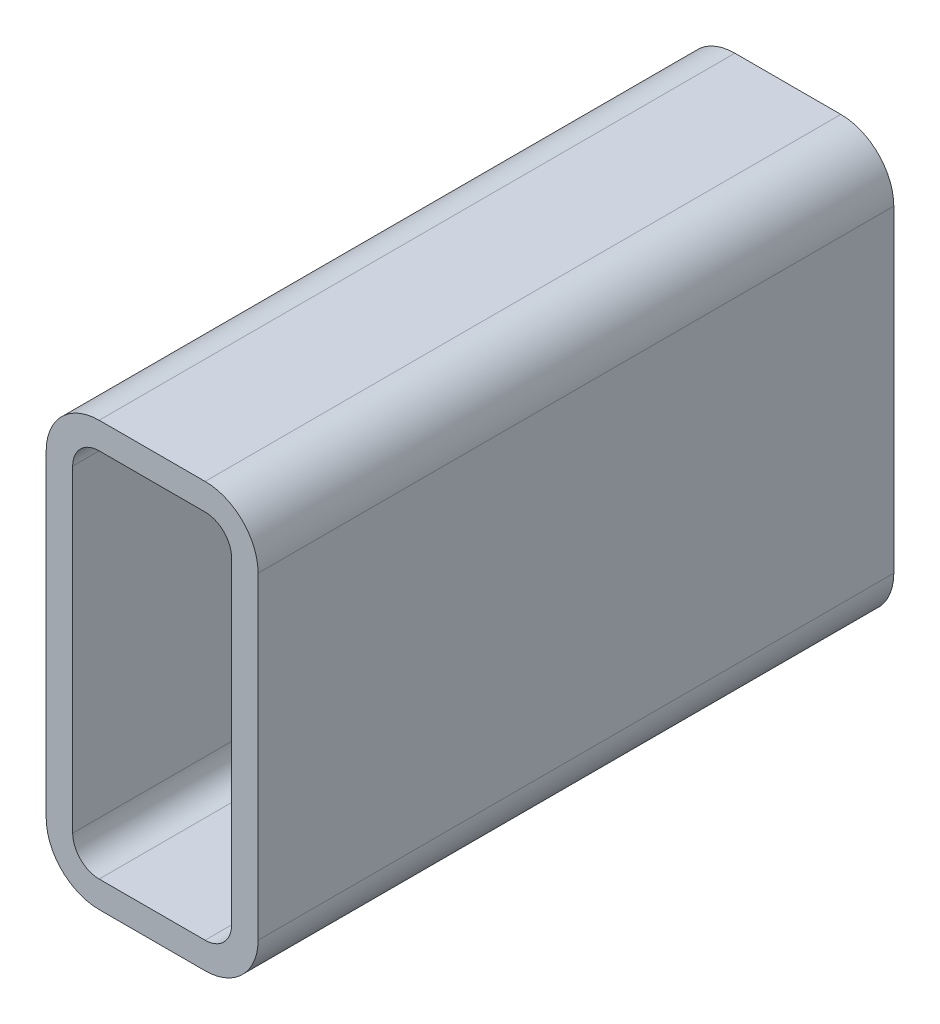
ISO-10303-21;
HEADER;
FILE_DESCRIPTION(('STEP AP214'),'2;1');
FILE_NAME('part.step','',(''),(''),'','','');
FILE_SCHEMA(('AUTOMOTIVE_DESIGN { 1 0 10303 214 1 1 1 1 }'));
ENDSEC;
DATA;
#1=APPLICATION_CONTEXT('core data for automotive mechanical design processes');
#2=APPLICATION_PROTOCOL_DEFINITION('international standard','automotive_design',2000,#1);
#3=PRODUCT_CONTEXT('',#1,'mechanical');
#4=PRODUCT('Part','Part','',(#3));
#5=PRODUCT_RELATED_PRODUCT_CATEGORY('part','',(#4));
#6=PRODUCT_DEFINITION_FORMATION('','',#4);
#7=PRODUCT_DEFINITION_CONTEXT('part definition',#1,'design');
#8=PRODUCT_DEFINITION('design','',#6,#7);
#9=PRODUCT_DEFINITION_SHAPE('','',#8);
#10=(LENGTH_UNIT() NAMED_UNIT(*) SI_UNIT(.MILLI.,.METRE.));
#11=(NAMED_UNIT(*) PLANE_ANGLE_UNIT() SI_UNIT($,.RADIAN.));
#12=(NAMED_UNIT(*) SI_UNIT($,.STERADIAN.) SOLID_ANGLE_UNIT());
#13=UNCERTAINTY_MEASURE_WITH_UNIT(LENGTH_MEASURE(1.E-05),#10,'distance_accuracy_value','');
#14=(GEOMETRIC_REPRESENTATION_CONTEXT(3) GLOBAL_UNCERTAINTY_ASSIGNED_CONTEXT((#13)) GLOBAL_UNIT_ASSIGNED_CONTEXT((#10,
#11,#12)) REPRESENTATION_CONTEXT('',''));
#15=CARTESIAN_POINT('',(0.,0.,0.));
#16=DIRECTION('',(0.,0.,1.));
#17=DIRECTION('',(1.,0.,0.));
#18=AXIS2_PLACEMENT_3D('',#15,#16,#17);
#19=CARTESIAN_POINT('',(27.0751778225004,179.766130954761,304.8));
#20=DIRECTION('',(0.,0.,1.));
#21=DIRECTION('',(1.,0.,0.));
#22=AXIS2_PLACEMENT_3D('',#19,#20,#21);
#23=PLANE('',#22);
#24=CARTESIAN_POINT('',(27.0751778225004,179.766130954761,304.8));
#25=DIRECTION('',(0.,0.,1.));
#26=DIRECTION('',(1.,0.,0.));
#27=AXIS2_PLACEMENT_3D('',#24,#25,#26);
#28=CIRCLE('',#27,25.4);
#29=CARTESIAN_POINT('',(27.0751778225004,205.166130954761,304.8));
#30=VERTEX_POINT('',#29);
#31=CARTESIAN_POINT('',(1.67517782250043,179.766130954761,304.8));
#32=VERTEX_POINT('',#31);
#33=EDGE_CURVE('E211',#30,#32,#28,.T.);
#34=ORIENTED_EDGE('',*,*,#33,.T.);
#35=DIRECTION('',(0.,-1.,0.));
#36=VECTOR('',#35,1.);
#37=CARTESIAN_POINT('',(1.67517782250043,27.3661309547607,304.8));
#38=LINE('',#37,#36);
#39=CARTESIAN_POINT('',(1.67517782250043,27.3661309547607,304.8));
#40=VERTEX_POINT('',#39);
#41=EDGE_CURVE('E214',#32,#40,#38,.T.);
#42=ORIENTED_EDGE('',*,*,#41,.T.);
#43=CARTESIAN_POINT('',(27.0751778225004,27.3661309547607,304.8));
#44=DIRECTION('',(0.,0.,1.));
#45=DIRECTION('',(1.,0.,0.));
#46=AXIS2_PLACEMENT_3D('',#43,#44,#45);
#47=CIRCLE('',#46,25.4);
#48=CARTESIAN_POINT('',(27.0751778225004,1.96613095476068,304.8));
#49=VERTEX_POINT('',#48);
#50=EDGE_CURVE('E217',#40,#49,#47,.T.);
#51=ORIENTED_EDGE('',*,*,#50,.T.);
#52=DIRECTION('',(1.,0.,0.));
#53=VECTOR('',#52,1.);
#54=CARTESIAN_POINT('',(77.8751778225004,1.96613095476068,304.8));
#55=LINE('',#54,#53);
#56=CARTESIAN_POINT('',(77.8751778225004,1.96613095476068,304.8));
#57=VERTEX_POINT('',#56);
#58=EDGE_CURVE('E219',#49,#57,#55,.T.);
#59=ORIENTED_EDGE('',*,*,#58,.T.);
#60=CARTESIAN_POINT('',(77.8751778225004,27.3661309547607,304.8));
#61=DIRECTION('',(0.,0.,1.));
#62=DIRECTION('',(1.,0.,0.));
#63=AXIS2_PLACEMENT_3D('',#60,#61,#62);
#64=CIRCLE('',#63,25.4);
#65=CARTESIAN_POINT('',(103.2751778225,27.3661309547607,304.8));
#66=VERTEX_POINT('',#65);
#67=EDGE_CURVE('E221',#57,#66,#64,.T.);
#68=ORIENTED_EDGE('',*,*,#67,.T.);
#69=DIRECTION('',(0.,1.,0.));
#70=VECTOR('',#69,1.);
#71=CARTESIAN_POINT('',(103.2751778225,179.766130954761,304.8));
#72=LINE('',#71,#70);
#73=CARTESIAN_POINT('',(103.2751778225,179.766130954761,304.8));
#74=VERTEX_POINT('',#73);
#75=EDGE_CURVE('E223',#66,#74,#72,.T.);
#76=ORIENTED_EDGE('',*,*,#75,.T.);
#77=CARTESIAN_POINT('',(77.8751778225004,179.766130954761,304.8));
#78=DIRECTION('',(0.,0.,1.));
#79=DIRECTION('',(1.,0.,0.));
#80=AXIS2_PLACEMENT_3D('',#77,#78,#79);
#81=CIRCLE('',#80,25.4);
#82=CARTESIAN_POINT('',(77.8751778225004,205.166130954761,304.8));
#83=VERTEX_POINT('',#82);
#84=EDGE_CURVE('E225',#74,#83,#81,.T.);
#85=ORIENTED_EDGE('',*,*,#84,.T.);
#86=DIRECTION('',(-1.,0.,0.));
#87=VECTOR('',#86,1.);
#88=CARTESIAN_POINT('',(27.0751778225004,205.166130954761,304.8));
#89=LINE('',#88,#87);
#90=EDGE_CURVE('E227',#83,#30,#89,.T.);
#91=ORIENTED_EDGE('',*,*,#90,.T.);
#92=EDGE_LOOP('',(#34,#42,#51,#59,#68,#76,#85,#91));
#93=FACE_BOUND('',#92,.T.);
#94=DIRECTION('',(0.,-1.,0.));
#95=VECTOR('',#94,1.);
#96=CARTESIAN_POINT('',(14.3751778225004,27.3661309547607,304.8));
#97=LINE('',#96,#95);
#98=CARTESIAN_POINT('',(14.3751778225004,179.766130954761,304.8));
#99=VERTEX_POINT('',#98);
#100=CARTESIAN_POINT('',(14.3751778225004,27.3661309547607,304.8));
#101=VERTEX_POINT('',#100);
#102=EDGE_CURVE('E154',#99,#101,#97,.T.);
#103=ORIENTED_EDGE('',*,*,#102,.F.);
#104=CARTESIAN_POINT('',(27.0751778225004,179.766130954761,304.8));
#105=DIRECTION('',(0.,0.,1.));
#106=DIRECTION('',(1.,0.,0.));
#107=AXIS2_PLACEMENT_3D('',#104,#105,#106);
#108=CIRCLE('',#107,12.7);
#109=CARTESIAN_POINT('',(27.0751778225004,192.466130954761,304.8));
#110=VERTEX_POINT('',#109);
#111=EDGE_CURVE('E146',#110,#99,#108,.T.);
#112=ORIENTED_EDGE('',*,*,#111,.F.);
#113=DIRECTION('',(-1.,0.,0.));
#114=VECTOR('',#113,1.);
#115=CARTESIAN_POINT('',(27.0751778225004,192.466130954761,304.8));
#116=LINE('',#115,#114);
#117=CARTESIAN_POINT('',(77.8751778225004,192.466130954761,304.8));
#118=VERTEX_POINT('',#117);
#119=EDGE_CURVE('E179',#118,#110,#116,.T.);
#120=ORIENTED_EDGE('',*,*,#119,.F.);
#121=CARTESIAN_POINT('',(77.8751778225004,179.766130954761,304.8));
#122=DIRECTION('',(0.,0.,1.));
#123=DIRECTION('',(1.,0.,0.));
#124=AXIS2_PLACEMENT_3D('',#121,#122,#123);
#125=CIRCLE('',#124,12.7);
#126=CARTESIAN_POINT('',(90.5751778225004,179.766130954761,304.8));
#127=VERTEX_POINT('',#126);
#128=EDGE_CURVE('E177',#127,#118,#125,.T.);
#129=ORIENTED_EDGE('',*,*,#128,.F.);
#130=DIRECTION('',(0.,1.,0.));
#131=VECTOR('',#130,1.);
#132=CARTESIAN_POINT('',(90.5751778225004,179.766130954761,304.8));
#133=LINE('',#132,#131);
#134=CARTESIAN_POINT('',(90.5751778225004,27.3661309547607,304.8));
#135=VERTEX_POINT('',#134);
#136=EDGE_CURVE('E175',#135,#127,#133,.T.);
#137=ORIENTED_EDGE('',*,*,#136,.F.);
#138=CARTESIAN_POINT('',(77.8751778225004,27.3661309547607,304.8));
#139=DIRECTION('',(0.,0.,1.));
#140=DIRECTION('',(1.,0.,0.));
#141=AXIS2_PLACEMENT_3D('',#138,#139,#140);
#142=CIRCLE('',#141,12.7);
#143=CARTESIAN_POINT('',(77.8751778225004,14.6661309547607,304.8));
#144=VERTEX_POINT('',#143);
#145=EDGE_CURVE('E173',#144,#135,#142,.T.);
#146=ORIENTED_EDGE('',*,*,#145,.F.);
#147=DIRECTION('',(1.,0.,0.));
#148=VECTOR('',#147,1.);
#149=CARTESIAN_POINT('',(77.8751778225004,14.6661309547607,304.8));
#150=LINE('',#149,#148);
#151=CARTESIAN_POINT('',(27.0751778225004,14.6661309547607,304.8));
#152=VERTEX_POINT('',#151);
#153=EDGE_CURVE('E169',#152,#144,#150,.T.);
#154=ORIENTED_EDGE('',*,*,#153,.F.);
#155=CARTESIAN_POINT('',(27.0751778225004,27.3661309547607,304.8));
#156=DIRECTION('',(0.,0.,1.));
#157=DIRECTION('',(1.,0.,0.));
#158=AXIS2_PLACEMENT_3D('',#155,#156,#157);
#159=CIRCLE('',#158,12.7);
#160=EDGE_CURVE('E167',#101,#152,#159,.T.);
#161=ORIENTED_EDGE('',*,*,#160,.F.);
#162=EDGE_LOOP('',(#103,#112,#120,#129,#137,#146,#154,#161));
#163=FACE_BOUND('',#162,.T.);
#164=ADVANCED_FACE('F33',(#93,#163),#23,.T.);
#165=CARTESIAN_POINT('',(27.0751778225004,179.766130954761,0.));
#166=DIRECTION('',(0.,0.,1.));
#167=DIRECTION('',(1.,0.,0.));
#168=AXIS2_PLACEMENT_3D('',#165,#166,#167);
#169=PLANE('',#168);
#170=CARTESIAN_POINT('',(27.0751778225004,179.766130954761,0.));
#171=DIRECTION('',(0.,0.,1.));
#172=DIRECTION('',(1.,0.,0.));
#173=AXIS2_PLACEMENT_3D('',#170,#171,#172);
#174=CIRCLE('',#173,25.4);
#175=CARTESIAN_POINT('',(27.0751778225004,205.166130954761,0.));
#176=VERTEX_POINT('',#175);
#177=CARTESIAN_POINT('',(1.67517782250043,179.766130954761,0.));
#178=VERTEX_POINT('',#177);
#179=EDGE_CURVE('E162',#176,#178,#174,.T.);
#180=ORIENTED_EDGE('',*,*,#179,.F.);
#181=DIRECTION('',(-1.,0.,0.));
#182=VECTOR('',#181,1.);
#183=CARTESIAN_POINT('',(27.0751778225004,205.166130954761,0.));
#184=LINE('',#183,#182);
#185=CARTESIAN_POINT('',(77.8751778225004,205.166130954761,0.));
#186=VERTEX_POINT('',#185);
#187=EDGE_CURVE('E215',#186,#176,#184,.T.);
#188=ORIENTED_EDGE('',*,*,#187,.F.);
#189=CARTESIAN_POINT('',(77.8751778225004,179.766130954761,0.));
#190=DIRECTION('',(0.,0.,1.));
#191=DIRECTION('',(1.,0.,0.));
#192=AXIS2_PLACEMENT_3D('',#189,#190,#191);
#193=CIRCLE('',#192,25.4);
#194=CARTESIAN_POINT('',(103.2751778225,179.766130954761,0.));
#195=VERTEX_POINT('',#194);
#196=EDGE_CURVE('E242',#195,#186,#193,.T.);
#197=ORIENTED_EDGE('',*,*,#196,.F.);
#198=DIRECTION('',(0.,1.,0.));
#199=VECTOR('',#198,1.);
#200=CARTESIAN_POINT('',(103.2751778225,179.766130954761,0.));
#201=LINE('',#200,#199);
#202=CARTESIAN_POINT('',(103.2751778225,27.3661309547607,0.));
#203=VERTEX_POINT('',#202);
#204=EDGE_CURVE('E240',#203,#195,#201,.T.);
#205=ORIENTED_EDGE('',*,*,#204,.F.);
#206=CARTESIAN_POINT('',(77.8751778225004,27.3661309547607,0.));
#207=DIRECTION('',(0.,0.,1.));
#208=DIRECTION('',(1.,0.,0.));
#209=AXIS2_PLACEMENT_3D('',#206,#207,#208);
#210=CIRCLE('',#209,25.4);
#211=CARTESIAN_POINT('',(77.8751778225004,1.96613095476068,0.));
#212=VERTEX_POINT('',#211);
#213=EDGE_CURVE('E238',#212,#203,#210,.T.);
#214=ORIENTED_EDGE('',*,*,#213,.F.);
#215=DIRECTION('',(1.,0.,0.));
#216=VECTOR('',#215,1.);
#217=CARTESIAN_POINT('',(77.8751778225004,1.96613095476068,0.));
#218=LINE('',#217,#216);
#219=CARTESIAN_POINT('',(27.0751778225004,1.96613095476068,0.));
#220=VERTEX_POINT('',#219);
#221=EDGE_CURVE('E236',#220,#212,#218,.T.);
#222=ORIENTED_EDGE('',*,*,#221,.F.);
#223=CARTESIAN_POINT('',(27.0751778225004,27.3661309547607,0.));
#224=DIRECTION('',(0.,0.,1.));
#225=DIRECTION('',(1.,0.,0.));
#226=AXIS2_PLACEMENT_3D('',#223,#224,#225);
#227=CIRCLE('',#226,25.4);
#228=CARTESIAN_POINT('',(1.67517782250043,27.3661309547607,0.));
#229=VERTEX_POINT('',#228);
#230=EDGE_CURVE('E234',#229,#220,#227,.T.);
#231=ORIENTED_EDGE('',*,*,#230,.F.);
#232=DIRECTION('',(0.,-1.,0.));
#233=VECTOR('',#232,1.);
#234=CARTESIAN_POINT('',(1.67517782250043,27.3661309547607,0.));
#235=LINE('',#234,#233);
#236=EDGE_CURVE('E232',#178,#229,#235,.T.);
#237=ORIENTED_EDGE('',*,*,#236,.F.);
#238=EDGE_LOOP('',(#180,#188,#197,#205,#214,#222,#231,#237));
#239=FACE_BOUND('',#238,.T.);
#240=CARTESIAN_POINT('',(27.0751778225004,179.766130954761,0.));
#241=DIRECTION('',(0.,0.,1.));
#242=DIRECTION('',(1.,0.,0.));
#243=AXIS2_PLACEMENT_3D('',#240,#241,#242);
#244=CIRCLE('',#243,12.7);
#245=CARTESIAN_POINT('',(27.0751778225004,192.466130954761,0.));
#246=VERTEX_POINT('',#245);
#247=CARTESIAN_POINT('',(14.3751778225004,179.766130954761,0.));
#248=VERTEX_POINT('',#247);
#249=EDGE_CURVE('E56',#246,#248,#244,.T.);
#250=ORIENTED_EDGE('',*,*,#249,.T.);
#251=DIRECTION('',(0.,-1.,0.));
#252=VECTOR('',#251,1.);
#253=CARTESIAN_POINT('',(14.3751778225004,27.3661309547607,0.));
#254=LINE('',#253,#252);
#255=CARTESIAN_POINT('',(14.3751778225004,27.3661309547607,0.));
#256=VERTEX_POINT('',#255);
#257=EDGE_CURVE('E161',#248,#256,#254,.T.);
#258=ORIENTED_EDGE('',*,*,#257,.T.);
#259=CARTESIAN_POINT('',(27.0751778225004,27.3661309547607,0.));
#260=DIRECTION('',(0.,0.,1.));
#261=DIRECTION('',(1.,0.,0.));
#262=AXIS2_PLACEMENT_3D('',#259,#260,#261);
#263=CIRCLE('',#262,12.7);
#264=CARTESIAN_POINT('',(27.0751778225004,14.6661309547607,0.));
#265=VERTEX_POINT('',#264);
#266=EDGE_CURVE('E183',#256,#265,#263,.T.);
#267=ORIENTED_EDGE('',*,*,#266,.T.);
#268=DIRECTION('',(1.,0.,0.));
#269=VECTOR('',#268,1.);
#270=CARTESIAN_POINT('',(77.8751778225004,14.6661309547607,0.));
#271=LINE('',#270,#269);
#272=CARTESIAN_POINT('',(77.8751778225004,14.6661309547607,0.));
#273=VERTEX_POINT('',#272);
#274=EDGE_CURVE('E186',#265,#273,#271,.T.);
#275=ORIENTED_EDGE('',*,*,#274,.T.);
#276=CARTESIAN_POINT('',(77.8751778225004,27.3661309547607,0.));
#277=DIRECTION('',(0.,0.,1.));
#278=DIRECTION('',(1.,0.,0.));
#279=AXIS2_PLACEMENT_3D('',#276,#277,#278);
#280=CIRCLE('',#279,12.7);
#281=CARTESIAN_POINT('',(90.5751778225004,27.3661309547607,0.));
#282=VERTEX_POINT('',#281);
#283=EDGE_CURVE('E189',#273,#282,#280,.T.);
#284=ORIENTED_EDGE('',*,*,#283,.T.);
#285=DIRECTION('',(0.,1.,0.));
#286=VECTOR('',#285,1.);
#287=CARTESIAN_POINT('',(90.5751778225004,179.766130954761,0.));
#288=LINE('',#287,#286);
#289=CARTESIAN_POINT('',(90.5751778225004,179.766130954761,0.));
#290=VERTEX_POINT('',#289);
#291=EDGE_CURVE('E192',#282,#290,#288,.T.);
#292=ORIENTED_EDGE('',*,*,#291,.T.);
#293=CARTESIAN_POINT('',(77.8751778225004,179.766130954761,0.));
#294=DIRECTION('',(0.,0.,1.));
#295=DIRECTION('',(1.,0.,0.));
#296=AXIS2_PLACEMENT_3D('',#293,#294,#295);
#297=CIRCLE('',#296,12.7);
#298=CARTESIAN_POINT('',(77.8751778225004,192.466130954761,0.));
#299=VERTEX_POINT('',#298);
#300=EDGE_CURVE('E195',#290,#299,#297,.T.);
#301=ORIENTED_EDGE('',*,*,#300,.T.);
#302=DIRECTION('',(-1.,0.,0.));
#303=VECTOR('',#302,1.);
#304=CARTESIAN_POINT('',(27.0751778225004,192.466130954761,0.));
#305=LINE('',#304,#303);
#306=EDGE_CURVE('E155',#299,#246,#305,.T.);
#307=ORIENTED_EDGE('',*,*,#306,.T.);
#308=EDGE_LOOP('',(#250,#258,#267,#275,#284,#292,#301,#307));
#309=FACE_BOUND('',#308,.T.);
#310=ADVANCED_FACE('F272',(#239,#309),#169,.F.);
#311=CARTESIAN_POINT('',(27.0751778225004,179.766130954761,304.8));
#312=DIRECTION('',(0.,0.,-1.));
#313=DIRECTION('',(-1.,0.,0.));
#314=AXIS2_PLACEMENT_3D('',#311,#312,#313);
#315=CYLINDRICAL_SURFACE('',#314,25.4);
#316=ORIENTED_EDGE('',*,*,#179,.T.);
#317=DIRECTION('',(0.,0.,-1.));
#318=VECTOR('',#317,1.);
#319=CARTESIAN_POINT('',(1.67517782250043,179.766130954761,304.8));
#320=LINE('',#319,#318);
#321=EDGE_CURVE('E11',#32,#178,#320,.T.);
#322=ORIENTED_EDGE('',*,*,#321,.F.);
#323=ORIENTED_EDGE('',*,*,#33,.F.);
#324=DIRECTION('',(0.,0.,-1.));
#325=VECTOR('',#324,1.);
#326=CARTESIAN_POINT('',(27.0751778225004,205.166130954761,304.8));
#327=LINE('',#326,#325);
#328=EDGE_CURVE('E229',#30,#176,#327,.T.);
#329=ORIENTED_EDGE('',*,*,#328,.T.);
#330=EDGE_LOOP('',(#316,#322,#323,#329));
#331=FACE_BOUND('',#330,.T.);
#332=ADVANCED_FACE('F35',(#331),#315,.T.);
#333=CARTESIAN_POINT('',(1.67517782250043,27.3661309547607,304.8));
#334=DIRECTION('',(1.,0.,0.));
#335=DIRECTION('',(0.,0.,-1.));
#336=AXIS2_PLACEMENT_3D('',#333,#334,#335);
#337=PLANE('',#336);
#338=ORIENTED_EDGE('',*,*,#236,.T.);
#339=DIRECTION('',(0.,0.,-1.));
#340=VECTOR('',#339,1.);
#341=CARTESIAN_POINT('',(1.67517782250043,27.3661309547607,304.8));
#342=LINE('',#341,#340);
#343=EDGE_CURVE('E41',#40,#229,#342,.T.);
#344=ORIENTED_EDGE('',*,*,#343,.F.);
#345=ORIENTED_EDGE('',*,*,#41,.F.);
#346=ORIENTED_EDGE('',*,*,#321,.T.);
#347=EDGE_LOOP('',(#338,#344,#345,#346));
#348=FACE_BOUND('',#347,.T.);
#349=ADVANCED_FACE('F289',(#348),#337,.F.);
#350=CARTESIAN_POINT('',(27.0751778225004,27.3661309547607,304.8));
#351=DIRECTION('',(0.,0.,-1.));
#352=DIRECTION('',(-1.,0.,0.));
#353=AXIS2_PLACEMENT_3D('',#350,#351,#352);
#354=CYLINDRICAL_SURFACE('',#353,25.4);
#355=ORIENTED_EDGE('',*,*,#230,.T.);
#356=DIRECTION('',(0.,0.,-1.));
#357=VECTOR('',#356,1.);
#358=CARTESIAN_POINT('',(27.0751778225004,1.96613095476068,304.8));
#359=LINE('',#358,#357);
#360=EDGE_CURVE('E259',#49,#220,#359,.T.);
#361=ORIENTED_EDGE('',*,*,#360,.F.);
#362=ORIENTED_EDGE('',*,*,#50,.F.);
#363=ORIENTED_EDGE('',*,*,#343,.T.);
#364=EDGE_LOOP('',(#355,#361,#362,#363));
#365=FACE_BOUND('',#364,.T.);
#366=ADVANCED_FACE('F266',(#365),#354,.T.);
#367=CARTESIAN_POINT('',(77.8751778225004,1.96613095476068,304.8));
#368=DIRECTION('',(0.,1.,0.));
#369=DIRECTION('',(0.,0.,1.));
#370=AXIS2_PLACEMENT_3D('',#367,#368,#369);
#371=PLANE('',#370);
#372=ORIENTED_EDGE('',*,*,#221,.T.);
#373=DIRECTION('',(0.,0.,-1.));
#374=VECTOR('',#373,1.);
#375=CARTESIAN_POINT('',(77.8751778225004,1.96613095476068,304.8));
#376=LINE('',#375,#374);
#377=EDGE_CURVE('E256',#57,#212,#376,.T.);
#378=ORIENTED_EDGE('',*,*,#377,.F.);
#379=ORIENTED_EDGE('',*,*,#58,.F.);
#380=ORIENTED_EDGE('',*,*,#360,.T.);
#381=EDGE_LOOP('',(#372,#378,#379,#380));
#382=FACE_BOUND('',#381,.T.);
#383=ADVANCED_FACE('F278',(#382),#371,.F.);
#384=CARTESIAN_POINT('',(77.8751778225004,27.3661309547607,304.8));
#385=DIRECTION('',(0.,0.,-1.));
#386=DIRECTION('',(-1.,0.,0.));
#387=AXIS2_PLACEMENT_3D('',#384,#385,#386);
#388=CYLINDRICAL_SURFACE('',#387,25.4);
#389=ORIENTED_EDGE('',*,*,#213,.T.);
#390=DIRECTION('',(0.,0.,-1.));
#391=VECTOR('',#390,1.);
#392=CARTESIAN_POINT('',(103.2751778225,27.3661309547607,304.8));
#393=LINE('',#392,#391);
#394=EDGE_CURVE('E253',#66,#203,#393,.T.);
#395=ORIENTED_EDGE('',*,*,#394,.F.);
#396=ORIENTED_EDGE('',*,*,#67,.F.);
#397=ORIENTED_EDGE('',*,*,#377,.T.);
#398=EDGE_LOOP('',(#389,#395,#396,#397));
#399=FACE_BOUND('',#398,.T.);
#400=ADVANCED_FACE('F282',(#399),#388,.T.);
#401=CARTESIAN_POINT('',(103.2751778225,179.766130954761,304.8));
#402=DIRECTION('',(-1.,0.,0.));
#403=DIRECTION('',(0.,0.,1.));
#404=AXIS2_PLACEMENT_3D('',#401,#402,#403);
#405=PLANE('',#404);
#406=ORIENTED_EDGE('',*,*,#204,.T.);
#407=DIRECTION('',(0.,0.,-1.));
#408=VECTOR('',#407,1.);
#409=CARTESIAN_POINT('',(103.2751778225,179.766130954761,304.8));
#410=LINE('',#409,#408);
#411=EDGE_CURVE('E250',#74,#195,#410,.T.);
#412=ORIENTED_EDGE('',*,*,#411,.F.);
#413=ORIENTED_EDGE('',*,*,#75,.F.);
#414=ORIENTED_EDGE('',*,*,#394,.T.);
#415=EDGE_LOOP('',(#406,#412,#413,#414));
#416=FACE_BOUND('',#415,.T.);
#417=ADVANCED_FACE('F302',(#416),#405,.F.);
#418=CARTESIAN_POINT('',(77.8751778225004,179.766130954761,304.8));
#419=DIRECTION('',(0.,0.,-1.));
#420=DIRECTION('',(-1.,0.,0.));
#421=AXIS2_PLACEMENT_3D('',#418,#419,#420);
#422=CYLINDRICAL_SURFACE('',#421,25.4);
#423=ORIENTED_EDGE('',*,*,#196,.T.);
#424=DIRECTION('',(0.,0.,-1.));
#425=VECTOR('',#424,1.);
#426=CARTESIAN_POINT('',(77.8751778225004,205.166130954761,304.8));
#427=LINE('',#426,#425);
#428=EDGE_CURVE('E247',#83,#186,#427,.T.);
#429=ORIENTED_EDGE('',*,*,#428,.F.);
#430=ORIENTED_EDGE('',*,*,#84,.F.);
#431=ORIENTED_EDGE('',*,*,#411,.T.);
#432=EDGE_LOOP('',(#423,#429,#430,#431));
#433=FACE_BOUND('',#432,.T.);
#434=ADVANCED_FACE('F300',(#433),#422,.T.);
#435=CARTESIAN_POINT('',(27.0751778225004,205.166130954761,304.8));
#436=DIRECTION('',(0.,-1.,0.));
#437=DIRECTION('',(0.,0.,-1.));
#438=AXIS2_PLACEMENT_3D('',#435,#436,#437);
#439=PLANE('',#438);
#440=ORIENTED_EDGE('',*,*,#187,.T.);
#441=ORIENTED_EDGE('',*,*,#328,.F.);
#442=ORIENTED_EDGE('',*,*,#90,.F.);
#443=ORIENTED_EDGE('',*,*,#428,.T.);
#444=EDGE_LOOP('',(#440,#441,#442,#443));
#445=FACE_BOUND('',#444,.T.);
#446=ADVANCED_FACE('F295',(#445),#439,.F.);
#447=CARTESIAN_POINT('',(27.0751778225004,179.766130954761,304.8));
#448=DIRECTION('',(0.,0.,-1.));
#449=DIRECTION('',(-1.,0.,0.));
#450=AXIS2_PLACEMENT_3D('',#447,#448,#449);
#451=CYLINDRICAL_SURFACE('',#450,12.7);
#452=ORIENTED_EDGE('',*,*,#249,.F.);
#453=DIRECTION('',(0.,0.,-1.));
#454=VECTOR('',#453,1.);
#455=CARTESIAN_POINT('',(27.0751778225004,192.466130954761,304.8));
#456=LINE('',#455,#454);
#457=EDGE_CURVE('E150',#110,#246,#456,.T.);
#458=ORIENTED_EDGE('',*,*,#457,.F.);
#459=ORIENTED_EDGE('',*,*,#111,.T.);
#460=DIRECTION('',(0.,0.,-1.));
#461=VECTOR('',#460,1.);
#462=CARTESIAN_POINT('',(14.3751778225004,179.766130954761,304.8));
#463=LINE('',#462,#461);
#464=EDGE_CURVE('E149',#99,#248,#463,.T.);
#465=ORIENTED_EDGE('',*,*,#464,.T.);
#466=EDGE_LOOP('',(#452,#458,#459,#465));
#467=FACE_BOUND('',#466,.T.);
#468=ADVANCED_FACE('F148',(#467),#451,.F.);
#469=CARTESIAN_POINT('',(14.3751778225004,27.3661309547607,304.8));
#470=DIRECTION('',(1.,0.,0.));
#471=DIRECTION('',(0.,0.,-1.));
#472=AXIS2_PLACEMENT_3D('',#469,#470,#471);
#473=PLANE('',#472);
#474=ORIENTED_EDGE('',*,*,#257,.F.);
#475=ORIENTED_EDGE('',*,*,#464,.F.);
#476=ORIENTED_EDGE('',*,*,#102,.T.);
#477=DIRECTION('',(0.,0.,-1.));
#478=VECTOR('',#477,1.);
#479=CARTESIAN_POINT('',(14.3751778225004,27.3661309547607,304.8));
#480=LINE('',#479,#478);
#481=EDGE_CURVE('E163',#101,#256,#480,.T.);
#482=ORIENTED_EDGE('',*,*,#481,.T.);
#483=EDGE_LOOP('',(#474,#475,#476,#482));
#484=FACE_BOUND('',#483,.T.);
#485=ADVANCED_FACE('F158',(#484),#473,.T.);
#486=CARTESIAN_POINT('',(27.0751778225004,27.3661309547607,304.8));
#487=DIRECTION('',(0.,0.,-1.));
#488=DIRECTION('',(-1.,0.,0.));
#489=AXIS2_PLACEMENT_3D('',#486,#487,#488);
#490=CYLINDRICAL_SURFACE('',#489,12.7);
#491=ORIENTED_EDGE('',*,*,#266,.F.);
#492=ORIENTED_EDGE('',*,*,#481,.F.);
#493=ORIENTED_EDGE('',*,*,#160,.T.);
#494=DIRECTION('',(0.,0.,-1.));
#495=VECTOR('',#494,1.);
#496=CARTESIAN_POINT('',(27.0751778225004,14.6661309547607,304.8));
#497=LINE('',#496,#495);
#498=EDGE_CURVE('E208',#152,#265,#497,.T.);
#499=ORIENTED_EDGE('',*,*,#498,.T.);
#500=EDGE_LOOP('',(#491,#492,#493,#499));
#501=FACE_BOUND('',#500,.T.);
#502=ADVANCED_FACE('F327',(#501),#490,.F.);
#503=CARTESIAN_POINT('',(77.8751778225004,14.6661309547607,304.8));
#504=DIRECTION('',(0.,1.,0.));
#505=DIRECTION('',(0.,0.,1.));
#506=AXIS2_PLACEMENT_3D('',#503,#504,#505);
#507=PLANE('',#506);
#508=ORIENTED_EDGE('',*,*,#274,.F.);
#509=ORIENTED_EDGE('',*,*,#498,.F.);
#510=ORIENTED_EDGE('',*,*,#153,.T.);
#511=DIRECTION('',(0.,0.,-1.));
#512=VECTOR('',#511,1.);
#513=CARTESIAN_POINT('',(77.8751778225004,14.6661309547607,304.8));
#514=LINE('',#513,#512);
#515=EDGE_CURVE('E206',#144,#273,#514,.T.);
#516=ORIENTED_EDGE('',*,*,#515,.T.);
#517=EDGE_LOOP('',(#508,#509,#510,#516));
#518=FACE_BOUND('',#517,.T.);
#519=ADVANCED_FACE('F331',(#518),#507,.T.);
#520=CARTESIAN_POINT('',(77.8751778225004,27.3661309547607,304.8));
#521=DIRECTION('',(0.,0.,-1.));
#522=DIRECTION('',(-1.,0.,0.));
#523=AXIS2_PLACEMENT_3D('',#520,#521,#522);
#524=CYLINDRICAL_SURFACE('',#523,12.7);
#525=ORIENTED_EDGE('',*,*,#283,.F.);
#526=ORIENTED_EDGE('',*,*,#515,.F.);
#527=ORIENTED_EDGE('',*,*,#145,.T.);
#528=DIRECTION('',(0.,0.,-1.));
#529=VECTOR('',#528,1.);
#530=CARTESIAN_POINT('',(90.5751778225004,27.3661309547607,304.8));
#531=LINE('',#530,#529);
#532=EDGE_CURVE('E204',#135,#282,#531,.T.);
#533=ORIENTED_EDGE('',*,*,#532,.T.);
#534=EDGE_LOOP('',(#525,#526,#527,#533));
#535=FACE_BOUND('',#534,.T.);
#536=ADVANCED_FACE('F337',(#535),#524,.F.);
#537=CARTESIAN_POINT('',(90.5751778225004,179.766130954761,304.8));
#538=DIRECTION('',(-1.,0.,0.));
#539=DIRECTION('',(0.,0.,1.));
#540=AXIS2_PLACEMENT_3D('',#537,#538,#539);
#541=PLANE('',#540);
#542=ORIENTED_EDGE('',*,*,#291,.F.);
#543=ORIENTED_EDGE('',*,*,#532,.F.);
#544=ORIENTED_EDGE('',*,*,#136,.T.);
#545=DIRECTION('',(0.,0.,-1.));
#546=VECTOR('',#545,1.);
#547=CARTESIAN_POINT('',(90.5751778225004,179.766130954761,304.8));
#548=LINE('',#547,#546);
#549=EDGE_CURVE('E202',#127,#290,#548,.T.);
#550=ORIENTED_EDGE('',*,*,#549,.T.);
#551=EDGE_LOOP('',(#542,#543,#544,#550));
#552=FACE_BOUND('',#551,.T.);
#553=ADVANCED_FACE('F341',(#552),#541,.T.);
#554=CARTESIAN_POINT('',(77.8751778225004,179.766130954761,304.8));
#555=DIRECTION('',(0.,0.,-1.));
#556=DIRECTION('',(-1.,0.,0.));
#557=AXIS2_PLACEMENT_3D('',#554,#555,#556);
#558=CYLINDRICAL_SURFACE('',#557,12.7);
#559=ORIENTED_EDGE('',*,*,#300,.F.);
#560=ORIENTED_EDGE('',*,*,#549,.F.);
#561=ORIENTED_EDGE('',*,*,#128,.T.);
#562=DIRECTION('',(0.,0.,-1.));
#563=VECTOR('',#562,1.);
#564=CARTESIAN_POINT('',(77.8751778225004,192.466130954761,304.8));
#565=LINE('',#564,#563);
#566=EDGE_CURVE('E48',#118,#299,#565,.T.);
#567=ORIENTED_EDGE('',*,*,#566,.T.);
#568=EDGE_LOOP('',(#559,#560,#561,#567));
#569=FACE_BOUND('',#568,.T.);
#570=ADVANCED_FACE('F345',(#569),#558,.F.);
#571=CARTESIAN_POINT('',(27.0751778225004,192.466130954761,304.8));
#572=DIRECTION('',(0.,-1.,0.));
#573=DIRECTION('',(0.,0.,-1.));
#574=AXIS2_PLACEMENT_3D('',#571,#572,#573);
#575=PLANE('',#574);
#576=ORIENTED_EDGE('',*,*,#306,.F.);
#577=ORIENTED_EDGE('',*,*,#566,.F.);
#578=ORIENTED_EDGE('',*,*,#119,.T.);
#579=ORIENTED_EDGE('',*,*,#457,.T.);
#580=EDGE_LOOP('',(#576,#577,#578,#579));
#581=FACE_BOUND('',#580,.T.);
#582=ADVANCED_FACE('F349',(#581),#575,.T.);
#583=CLOSED_SHELL('',(#164,#310,#332,#349,#366,#383,#400,#417,#434,#446,#468,#485,#502,#519,
#536,#553,#570,#582));
#584=MANIFOLD_SOLID_BREP('B2',#583);
#585=ADVANCED_BREP_SHAPE_REPRESENTATION('',(#18,#584),#14);
#586=SHAPE_DEFINITION_REPRESENTATION(#9,#585);
ENDSEC;
END-ISO-10303-21;
